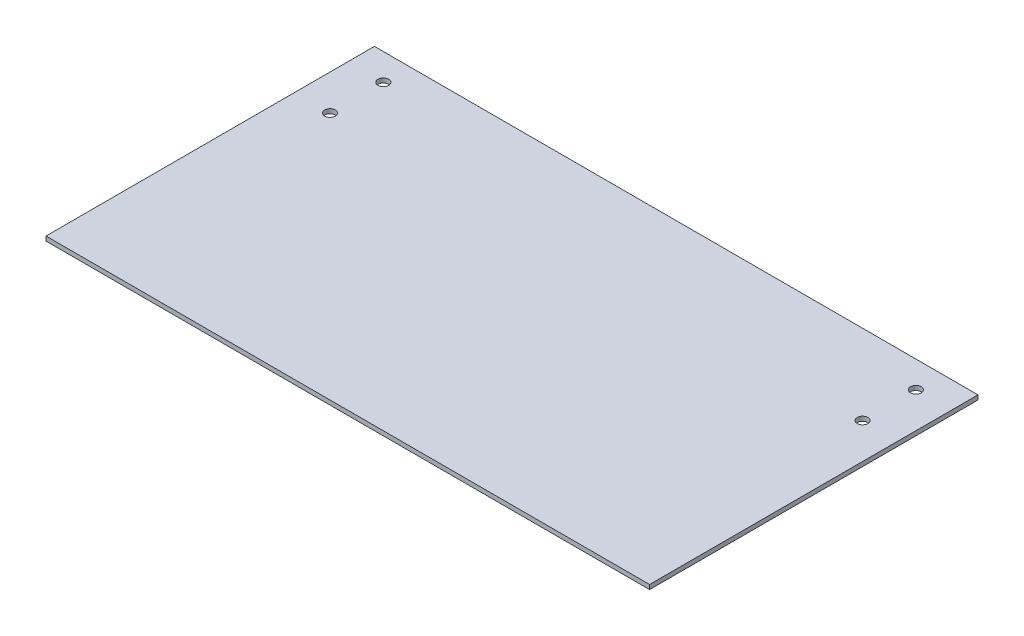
from build123d import *

# Parameters (mm, degrees)
SKETCH1_W           = 340
SKETCH1_H           = 185
BOSS_EXTRUDE1_DEPTH = 2.5
SKETCH2_R           = 3
CUT_EXTRUDE1_DEPTH  = 194.552318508


with BuildPart() as part:
    # Sketch1 → Boss-Extrude1 (new body)
    with BuildSketch(Plane(origin=(0, 0, 0), x_dir=(1, 0, 0), z_dir=(0, 1, 0))):
        Rectangle(SKETCH1_W, SKETCH1_H)
    extrude(amount=BOSS_EXTRUDE1_DEPTH)

    # Sketch2 → Cut-Extrude1 (cut, through all)
    with BuildSketch(Plane(origin=(0, 2.5, 0), x_dir=(1, 0, 0), z_dir=(0, 1, 0))):
        with Locations(Location((-150, 77.5, 0), (0, 0, 270))):
            Circle(SKETCH2_R)
        with Locations(Location((-150, 47.5, 0), (0, 0, 270))):
            Circle(SKETCH2_R)
        with Locations(Location((150, 77.5, 0), (0, 0, 270))):
            Circle(SKETCH2_R)
        with Locations(Location((150, 47.5, 0), (0, 0, 270))):
            Circle(SKETCH2_R)
    extrude(amount=-CUT_EXTRUDE1_DEPTH, mode=Mode.SUBTRACT)


solid = part.part
